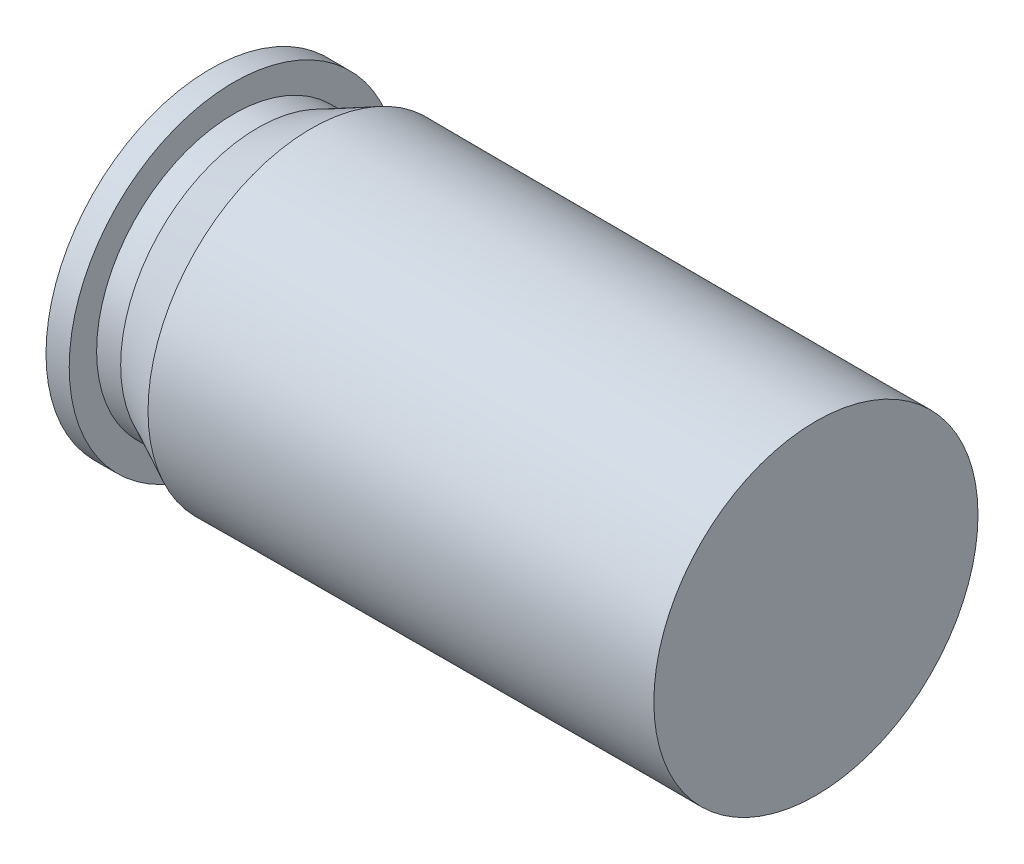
from build123d import *

# Parameters (mm, degrees)
CUT_EXTRUDE1_DEPTH = 0.25
CUT_EXTRUDE2_DEPTH = 0.25


with BuildPart() as part:
    # Sketch1 → Revolve2 (revolve)
    with BuildSketch(Plane.XY, mode=Mode.PRIVATE) as revolve2_sk:
        Polygon((0, 0), (0, 5.552303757), (0.38, 6.095), (1.24, 6.095), (1.24, 5.08), (2.131456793, 5.08), (4.11, 6.045), (22.81, 6.005), (22.81, 0), (22.641116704, 0), align=None)
    revolve(revolve2_sk.sketch.rotate(Axis((0, 0, 0), (1, 0, 0)), 90), axis=Axis((0, 0, 0), (1, 0, 0)))

    # Sketch2 → Cut-Extrude1 (cut)
    # profile 1 of 6: a face of its own
    with BuildSketch(Plane.ZY):
        Polygon((-3.042432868, -2.588485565), (-3.024404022, -2.612824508), (-3.861843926, -3.232415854), (-3.75427181, -3.377848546), (-3.869355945, -3.463185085), (-3.97692806, -3.317752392), (-4.256375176, -3.524483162), (-4.345317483, -3.404591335), (-4.065870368, -3.197860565), (-4.491050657, -2.623341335), align=None)
        Polygon((-3.950786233, -3.112524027), (-3.449884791, -2.742031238), (-4.212504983, -2.758557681), align=None, mode=Mode.SUBTRACT)
    # profile 2 of 6: a face of its own
    with BuildSketch(Plane.ZY):
        with BuildLine():
            Line((-2.050397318, -3.48956887), (-2.135132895, -3.603751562))
            Line((-2.135132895, -3.603751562), (-2.563317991, -3.285842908))
            Line((-2.563317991, -3.285842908), (-2.866503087, -3.569196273))
            add(Edge.make_bspline(
                [(-2.866503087, -3.569196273), (-2.851190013, -3.575100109), (-2.821490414, -3.586550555), (-2.779848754, -3.606537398), (-2.741786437, -3.627205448), (-2.71912428, -3.643389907), (-2.708149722, -3.651227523)],
                knots=[0, 0, 0, 0, 1.100237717, 2.133903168, 3.096309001, 4, 4, 4, 4], degree=3))
            add(Edge.make_bspline(
                [(-2.708149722, -3.651227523), (-2.694917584, -3.661495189), (-2.668974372, -3.681626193), (-2.634315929, -3.71554438), (-2.604040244, -3.751486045), (-2.578053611, -3.789534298), (-2.556247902, -3.829642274), (-2.539023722, -3.871972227), (-2.526450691, -3.916441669), (-2.518111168, -3.962427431), (-2.514131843, -4.009221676), (-2.515037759, -4.055945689), (-2.520722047, -4.102082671), (-2.531453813, -4.147659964), (-2.546808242, -4.192613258), (-2.566748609, -4.23717088), (-2.591900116, -4.280861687), (-2.611570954, -4.308828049), (-2.62161126, -4.323102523)],
                knots=[0, 0, 0, 0, 1.057630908, 2.073613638, 3.057386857, 4.022891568, 4.980083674, 5.93677347, 6.904371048, 7.895021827, 8.885773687, 9.866957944, 10.842738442, 11.817594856, 12.820322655, 13.840161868, 14.897584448, 16, 16, 16, 16], degree=3))
            add(Edge.make_bspline(
                [(-2.62161126, -4.323102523), (-2.629012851, -4.332707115), (-2.643691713, -4.351754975), (-2.667535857, -4.378600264), (-2.692816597, -4.403490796), (-2.719192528, -4.42671643), (-2.746994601, -4.447771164), (-2.775886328, -4.467048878), (-2.80606146, -4.484577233), (-2.847523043, -4.505098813), (-2.900837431, -4.525330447), (-2.966311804, -4.540776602), (-3.032502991, -4.545979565), (-3.087773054, -4.543190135), (-3.131618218, -4.5358259), (-3.164546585, -4.528488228), (-3.196893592, -4.518126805), (-3.228936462, -4.505647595), (-3.260932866, -4.491374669), (-3.292291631, -4.474113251), (-3.323537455, -4.454820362), (-3.343648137, -4.440411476), (-3.353882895, -4.433078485)],
                knots=[0, 0, 0, 0, 0.876650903, 1.738577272, 2.593874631, 3.440789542, 4.27807993, 5.113739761, 5.951030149, 6.799677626, 8.456955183, 10.062772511, 11.647081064, 13.242870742, 14.05017751, 14.860144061, 15.680215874, 16.503384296, 17.346170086, 18.211498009, 19.089792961, 20, 20, 20, 20], degree=3))
            add(Edge.make_bspline(
                [(-3.353882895, -4.433078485), (-3.365670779, -4.423966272), (-3.388842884, -4.406053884), (-3.420183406, -4.376113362), (-3.447858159, -4.34440903), (-3.472552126, -4.31126445), (-3.493225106, -4.276025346), (-3.510374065, -4.239150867), (-3.524444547, -4.200717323), (-3.534430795, -4.16070195), (-3.541044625, -4.119887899), (-3.544145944, -4.078965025), (-3.543253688, -4.038205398), (-3.538343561, -3.997788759), (-3.529883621, -3.95767751), (-3.517835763, -3.91782471), (-3.501805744, -3.878261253), (-3.488602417, -3.852652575), (-3.481887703, -3.839628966)],
                knots=[0, 0, 0, 0, 1.072612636, 2.10849487, 3.115640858, 4.101160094, 5.081091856, 6.052568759, 7.027041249, 8.024398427, 9.018305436, 10.002106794, 10.976285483, 11.949876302, 12.930418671, 13.925477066, 14.944975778, 16, 16, 16, 16], degree=3))
            Line((-3.481887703, -3.839628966), (-3.358690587, -3.9312756))
            add(Edge.make_bspline(
                [(-3.358690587, -3.9312756), (-3.364332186, -3.944202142), (-3.375221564, -3.969152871), (-3.387257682, -4.006927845), (-3.393785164, -4.043397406), (-3.396255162, -4.078634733), (-3.393229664, -4.113050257), (-3.386460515, -4.147227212), (-3.374558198, -4.181093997), (-3.359560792, -4.214785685), (-3.340519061, -4.24704674), (-3.31770491, -4.276579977), (-3.292257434, -4.303684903), (-3.272857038, -4.319023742), (-3.263137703, -4.326708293)],
                knots=[0, 0, 0, 0, 1.144156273, 2.208443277, 3.208040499, 4.144476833, 5.065835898, 6.003118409, 6.964410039, 7.972070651, 8.992435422, 9.995463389, 10.995754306, 12, 12, 12, 12], degree=3))
            add(Edge.make_bspline(
                [(-3.263137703, -4.326708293), (-3.253249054, -4.333618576), (-3.233656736, -4.347309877), (-3.202365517, -4.364135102), (-3.169904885, -4.377211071), (-3.136403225, -4.386441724), (-3.102008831, -4.392541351), (-3.066542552, -4.39503607), (-3.030031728, -4.393228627), (-2.992794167, -4.388604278), (-2.955852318, -4.38026173), (-2.920153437, -4.368438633), (-2.88599578, -4.353492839), (-2.853724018, -4.334598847), (-2.822924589, -4.312586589), (-2.79375526, -4.287150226), (-2.765802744, -4.258639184), (-2.749304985, -4.23724466), (-2.740902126, -4.226347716)],
                knots=[0, 0, 0, 0, 0.977084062, 1.935890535, 2.871955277, 3.807456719, 4.746964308, 5.698908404, 6.681942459, 7.704885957, 8.736775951, 9.745579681, 10.748619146, 11.752446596, 12.770612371, 13.81219467, 14.885677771, 16, 16, 16, 16], degree=3))
            add(Edge.make_bspline(
                [(-2.740902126, -4.226347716), (-2.733810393, -4.216247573), (-2.719911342, -4.196452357), (-2.702506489, -4.165324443), (-2.688189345, -4.134044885), (-2.677543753, -4.102229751), (-2.670623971, -4.070076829), (-2.667320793, -4.037526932), (-2.667373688, -4.004716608), (-2.67055754, -3.971652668), (-2.677618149, -3.939102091), (-2.687375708, -3.907242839), (-2.701129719, -3.876816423), (-2.717978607, -3.847404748), (-2.738640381, -3.819561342), (-2.762181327, -3.792552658), (-2.789321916, -3.766973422), (-2.809376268, -3.751424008), (-2.819628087, -3.74347512)],
                knots=[0, 0, 0, 0, 1.074592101, 2.106087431, 3.101977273, 4.067784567, 5.022809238, 5.961427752, 6.912577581, 7.877240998, 8.849335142, 9.809766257, 10.77462699, 11.751994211, 12.757320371, 13.789996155, 14.870242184, 16, 16, 16, 16], degree=3))
            add(Edge.make_bspline(
                [(-2.819628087, -3.74347512), (-2.828853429, -3.736928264), (-2.84786095, -3.723439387), (-2.879011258, -3.705274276), (-2.912882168, -3.687850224), (-2.949764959, -3.671655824), (-2.989399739, -3.656406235), (-3.0319057, -3.641996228), (-3.077259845, -3.628362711), (-3.108752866, -3.620637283), (-3.124916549, -3.616672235)],
                knots=[0, 0, 0, 0, 0.81571272, 1.680661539, 2.598412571, 3.562413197, 4.584890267, 5.661100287, 6.799567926, 8, 8, 8, 8], degree=3))
            Line((-3.124916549, -3.616672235), (-2.57083001, -3.10285012))
            Line((-2.57083001, -3.10285012), (-2.050397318, -3.48956887))
        make_face()
    # profile 3 of 6: a face of its own
    with BuildSketch(Plane.ZY):
        Polygon((-0.43310409, -3.985758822), (0.095742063, -5.538643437), (-0.062911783, -5.521516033), (-0.242298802, -5.010097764), (-0.879318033, -4.940987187), (-1.16327236, -5.401924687), (-1.327935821, -5.384196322), (-0.469161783, -3.981852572), align=None)
        Polygon((-0.485087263, -4.29765786), (-0.797587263, -4.80547036), (-0.29217861, -4.86015786), align=None, mode=Mode.SUBTRACT)
    # profile 4 of 6: a face of its own
    with BuildSketch(Plane.ZY):
        with BuildLine():
            Line((0.476907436, -4.018437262), (0.621739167, -3.98237957))
            Line((0.621739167, -3.98237957), (0.838385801, -4.857980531))
            add(Edge.make_bspline(
                [(0.838385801, -4.857980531), (0.841495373, -4.87029911), (0.847411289, -4.893735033), (0.855765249, -4.927128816), (0.863481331, -4.956805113), (0.870819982, -4.982685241), (0.877039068, -5.004976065), (0.882641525, -5.02354749), (0.887771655, -5.038339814), (0.891052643, -5.046889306), (0.89247234, -5.050588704)],
                knots=[0, 0, 0, 0, 1.523314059, 2.898083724, 4.127304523, 5.199552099, 6.123318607, 6.902062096, 7.524917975, 8, 8, 8, 8], degree=3))
            add(Edge.make_bspline(
                [(0.89247234, -5.050588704), (0.89803188, -5.063824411), (0.908804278, -5.089470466), (0.928614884, -5.124983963), (0.951590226, -5.155757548), (0.977241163, -5.182673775), (1.006935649, -5.205377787), (1.041504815, -5.223577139), (1.080385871, -5.23866858), (1.123208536, -5.24933044), (1.167670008, -5.256373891), (1.212090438, -5.257946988), (1.255526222, -5.255760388), (1.283551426, -5.249782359), (1.297520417, -5.246802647)],
                knots=[0, 0, 0, 0, 1.042740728, 2.020457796, 2.946272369, 3.826475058, 4.714467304, 5.649108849, 6.656080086, 7.738211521, 8.849923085, 9.920735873, 10.963603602, 12, 12, 12, 12], degree=3))
            add(Edge.make_bspline(
                [(1.297520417, -5.246802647), (1.309337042, -5.243476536), (1.332827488, -5.236864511), (1.366289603, -5.221987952), (1.398465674, -5.20440758), (1.428299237, -5.18264916), (1.455807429, -5.15830863), (1.480093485, -5.131285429), (1.500997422, -5.102029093), (1.518170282, -5.070304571), (1.5316546, -5.036368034), (1.542054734, -5.000396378), (1.548315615, -4.962155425), (1.549580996, -4.935927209), (1.550224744, -4.922583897)],
                knots=[0, 0, 0, 0, 0.995365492, 1.978701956, 2.965126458, 3.967079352, 4.969164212, 5.942227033, 6.910146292, 7.881611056, 8.863063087, 9.869394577, 10.916078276, 12, 12, 12, 12], degree=3))
            add(Edge.make_bspline(
                [(1.550224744, -4.922583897), (1.550207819, -4.917071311), (1.550170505, -4.90491744), (1.548096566, -4.884861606), (1.544746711, -4.861336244), (1.540199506, -4.834290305), (1.534447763, -4.803724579), (1.527271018, -4.76965377), (1.518423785, -4.732043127), (1.512079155, -4.705833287), (1.508758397, -4.692115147)],
                knots=[0, 0, 0, 0, 0.563622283, 1.242645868, 2.059887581, 2.994745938, 4.047742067, 5.241388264, 6.556152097, 8, 8, 8, 8], degree=3))
            Line((1.508758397, -4.692115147), (1.292111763, -3.816514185))
            Line((1.292111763, -3.816514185), (1.437243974, -3.780756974))
            Line((1.437243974, -3.780756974), (1.653890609, -4.656357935))
            add(Edge.make_bspline(
                [(1.653890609, -4.656357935), (1.657698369, -4.672160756), (1.665123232, -4.702975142), (1.674302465, -4.748511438), (1.682386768, -4.791924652), (1.687861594, -4.833476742), (1.692396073, -4.87281775), (1.694309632, -4.910241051), (1.695084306, -4.945626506), (1.693920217, -4.979344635), (1.69075232, -5.011828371), (1.684626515, -5.043683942), (1.675847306, -5.075076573), (1.664907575, -5.106301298), (1.650288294, -5.136578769), (1.634425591, -5.167176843), (1.61482045, -5.196776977), (1.593526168, -5.226159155), (1.569621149, -5.254010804), (1.543258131, -5.279717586), (1.514810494, -5.303191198), (1.483930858, -5.323946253), (1.451075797, -5.342364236), (1.415933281, -5.358235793), (1.378789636, -5.37228798), (1.352779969, -5.379143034), (1.339587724, -5.382619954)],
                knots=[0, 0, 0, 0, 1.299272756, 2.533490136, 3.712968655, 4.828307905, 5.883150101, 6.87755384, 7.822472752, 8.711786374, 9.573011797, 10.42882359, 11.30099598, 12.177274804, 13.06921565, 13.986211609, 14.930078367, 15.903732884, 16.885942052, 17.859794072, 18.843959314, 19.829946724, 20.83003952, 21.851160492, 22.91009694, 24, 24, 24, 24], degree=3))
            add(Edge.make_bspline(
                [(1.339587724, -5.382619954), (1.325204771, -5.385935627), (1.29680548, -5.392482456), (1.254187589, -5.398509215), (1.212569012, -5.402452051), (1.171774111, -5.40261796), (1.131884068, -5.400036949), (1.092950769, -5.394165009), (1.054872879, -5.385940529), (1.018064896, -5.374104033), (0.982680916, -5.35978646), (0.949340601, -5.342956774), (0.918123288, -5.323950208), (0.889165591, -5.30252779), (0.862303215, -5.278704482), (0.83762191, -5.252422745), (0.81493945, -5.223966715), (0.801942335, -5.203361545), (0.795417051, -5.193016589)],
                knots=[0, 0, 0, 0, 1.144258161, 2.259349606, 3.335415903, 4.384160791, 5.419703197, 6.432620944, 7.435299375, 8.437676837, 9.427269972, 10.39306903, 11.331004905, 12.258556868, 13.183013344, 14.111735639, 15.051984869, 16, 16, 16, 16], degree=3))
            add(Edge.make_bspline(
                [(0.795417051, -5.193016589), (0.791281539, -5.185871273), (0.782292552, -5.17034015), (0.770737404, -5.143757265), (0.758314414, -5.113036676), (0.745788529, -5.0778168), (0.732985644, -5.038204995), (0.719615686, -4.994192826), (0.706611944, -4.945614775), (0.698019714, -4.911676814), (0.693554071, -4.894038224)],
                knots=[0, 0, 0, 0, 0.625093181, 1.358708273, 2.193013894, 3.13644077, 4.190042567, 5.347305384, 6.621313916, 8, 8, 8, 8], degree=3))
            Line((0.693554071, -4.894038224), (0.476907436, -4.018437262))
        make_face()
    # profile 5 of 6: a face of its own
    with BuildSketch(Plane.ZY):
        Polygon((1.784738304, -3.808198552), (1.710820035, -3.683499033), (2.415447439, -3.265229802), (2.489365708, -3.389929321), (2.203007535, -3.560001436), (2.891709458, -4.719857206), (2.760699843, -4.797381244), (2.07199792, -3.637525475), align=None)
    # profile 6 of 6: a face of its own
    with BuildSketch(Plane.ZY):
        with BuildLine():
            add(Edge.make_bspline(
                [(2.993287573, -2.571302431), (3.011215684, -2.550392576), (3.046501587, -2.50923804), (3.105522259, -2.454908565), (3.167379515, -2.407460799), (3.232207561, -2.366609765), (3.300924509, -2.334109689), (3.372356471, -2.307475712), (3.447412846, -2.289056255), (3.524660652, -2.277494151), (3.60253479, -2.272758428), (3.679309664, -2.27625633), (3.754193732, -2.286510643), (3.827050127, -2.305134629), (3.897964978, -2.331030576), (3.966736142, -2.364696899), (4.033666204, -2.405639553), (4.075417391, -2.438170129), (4.096652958, -2.454715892)],
                knots=[0, 0, 0, 0, 1.066948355, 2.09995555, 3.102509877, 4.086142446, 5.063849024, 6.044081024, 7.036615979, 8.053562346, 9.068609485, 10.055730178, 11.02817248, 11.993402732, 12.96500755, 13.949589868, 14.957116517, 16, 16, 16, 16], degree=3))
            add(Edge.make_bspline(
                [(4.096652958, -2.454715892), (4.116828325, -2.47217709), (4.156522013, -2.506530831), (4.20945581, -2.563787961), (4.255066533, -2.624726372), (4.29479689, -2.688677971), (4.326421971, -2.756742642), (4.352064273, -2.82794899), (4.369843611, -2.902976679), (4.381196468, -2.98039452), (4.385453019, -3.058557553), (4.382256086, -3.135564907), (4.371334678, -3.210440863), (4.353303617, -3.283276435), (4.327669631, -3.353910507), (4.294167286, -3.422210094), (4.253678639, -3.488660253), (4.221467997, -3.530130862), (4.205126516, -3.551170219)],
                knots=[0, 0, 0, 0, 1.043280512, 2.05258477, 3.043171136, 4.017630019, 4.992222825, 5.973809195, 6.973621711, 8.003243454, 9.031342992, 10.031477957, 11.013439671, 11.986613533, 12.962151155, 13.947048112, 14.95847232, 16, 16, 16, 16], degree=3))
            add(Edge.make_bspline(
                [(4.205126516, -3.551170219), (4.187504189, -3.571688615), (4.152826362, -3.612065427), (4.094576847, -3.665125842), (4.033678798, -3.711955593), (3.969004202, -3.751519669), (3.90080439, -3.784048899), (3.829267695, -3.809785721), (3.75430552, -3.828023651), (3.677039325, -3.839320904), (3.599188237, -3.843495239), (3.522491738, -3.840688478), (3.447997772, -3.830106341), (3.375722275, -3.812274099), (3.305582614, -3.787240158), (3.237754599, -3.75456063), (3.172092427, -3.71448699), (3.131216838, -3.682689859), (3.110475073, -3.666554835)],
                knots=[0, 0, 0, 0, 1.058309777, 2.08257879, 3.078881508, 4.063042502, 5.045505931, 6.03307667, 7.034807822, 8.061567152, 9.086766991, 10.083810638, 11.062304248, 12.027882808, 12.994345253, 13.973271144, 14.971563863, 16, 16, 16, 16], degree=3))
            add(Edge.make_bspline(
                [(3.110475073, -3.666554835), (3.096993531, -3.655113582), (3.070277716, -3.632440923), (3.033227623, -3.595489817), (2.998951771, -3.556712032), (2.967352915, -3.516058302), (2.938386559, -3.47370101), (2.912581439, -3.429324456), (2.889231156, -3.383279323), (2.869374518, -3.335364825), (2.852169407, -3.286450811), (2.838318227, -3.236983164), (2.82814135, -3.187261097), (2.821129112, -3.137385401), (2.817588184, -3.087292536), (2.817166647, -3.036892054), (2.820629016, -2.986310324), (2.827138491, -2.935709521), (2.837124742, -2.885658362), (2.849889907, -2.836593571), (2.866297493, -2.788984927), (2.885546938, -2.742612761), (2.907758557, -2.697502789), (2.93310669, -2.653875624), (2.961350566, -2.611483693), (2.982575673, -2.584779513), (2.993287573, -2.571302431)],
                knots=[0, 0, 0, 0, 1.038466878, 2.057886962, 3.070901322, 4.077279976, 5.081023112, 6.083178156, 7.091069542, 8.111779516, 9.127882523, 10.13582544, 11.127141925, 12.107447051, 13.092667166, 14.075371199, 15.066058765, 16.068904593, 17.070593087, 18.062555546, 19.045083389, 20.026412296, 21.010630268, 21.996693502, 22.988970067, 24, 24, 24, 24], degree=3))
        make_face()
        with BuildLine():
            add(Edge.make_bspline(
                [(3.109874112, -2.658141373), (3.101389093, -2.668832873), (3.084541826, -2.690061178), (3.062339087, -2.724102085), (3.042241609, -2.759102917), (3.024371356, -2.795388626), (3.008918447, -2.832979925), (2.996574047, -2.87208783), (2.985837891, -2.912237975), (2.977831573, -2.953399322), (2.972433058, -2.995051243), (2.96970681, -3.036602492), (2.96968525, -3.077758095), (2.972421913, -3.118611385), (2.977800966, -3.159070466), (2.985914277, -3.199133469), (2.99688597, -3.238743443), (3.010271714, -3.277944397), (3.026462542, -3.316287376), (3.045208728, -3.353386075), (3.066187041, -3.389185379), (3.089799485, -3.423528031), (3.115660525, -3.456762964), (3.144256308, -3.48839514), (3.174881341, -3.519113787), (3.197166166, -3.537811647), (3.208431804, -3.547263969)],
                knots=[0, 0, 0, 0, 0.987347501, 1.960409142, 2.937727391, 3.907028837, 4.885636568, 5.875933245, 6.872840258, 7.892133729, 8.908122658, 9.910574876, 10.903653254, 11.88440635, 12.87164741, 13.85539616, 14.8401859, 15.844235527, 16.851263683, 17.849724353, 18.850497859, 19.851770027, 20.863898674, 21.895693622, 22.936210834, 24, 24, 24, 24], degree=3))
            add(Edge.make_bspline(
                [(3.208431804, -3.547263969), (3.225536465, -3.560495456), (3.259226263, -3.586556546), (3.312961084, -3.619792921), (3.368500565, -3.646622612), (3.425565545, -3.667523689), (3.484266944, -3.682321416), (3.544676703, -3.691166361), (3.606793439, -3.693269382), (3.669766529, -3.69011875), (3.732043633, -3.680868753), (3.792145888, -3.6660164), (3.849591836, -3.646354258), (3.903893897, -3.620576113), (3.955284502, -3.589511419), (4.003529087, -3.552770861), (4.049287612, -3.511053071), (4.076531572, -3.479450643), (4.090342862, -3.463429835)],
                knots=[0, 0, 0, 0, 1.051941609, 2.071932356, 3.068271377, 4.049046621, 5.024416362, 6.009530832, 7.01445428, 8.044390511, 9.074326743, 10.073345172, 11.053805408, 12.02414366, 12.993060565, 13.970912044, 14.971356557, 16, 16, 16, 16], degree=3))
            add(Edge.make_bspline(
                [(4.090342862, -3.463429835), (4.099224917, -3.452337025), (4.116861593, -3.430310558), (4.140229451, -3.395207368), (4.161261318, -3.359165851), (4.179973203, -3.322200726), (4.196018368, -3.284174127), (4.209133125, -3.24504354), (4.220024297, -3.204919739), (4.228402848, -3.163979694), (4.234094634, -3.122622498), (4.237092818, -3.081375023), (4.237541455, -3.040404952), (4.234628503, -2.999874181), (4.229651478, -2.959584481), (4.221578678, -2.919684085), (4.210204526, -2.880260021), (4.196879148, -2.84121218), (4.180608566, -2.803101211), (4.161874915, -2.766166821), (4.141277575, -2.730206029), (4.117711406, -2.695969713), (4.091735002, -2.663116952), (4.06350317, -2.631543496), (4.032758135, -2.601357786), (4.010731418, -2.582591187), (3.99959767, -2.573105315)],
                knots=[0, 0, 0, 0, 1.024795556, 2.034887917, 3.038757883, 4.034087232, 5.02183341, 6.013562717, 7.009206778, 8.019635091, 9.026232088, 10.018829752, 11.00159424, 11.979271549, 12.948150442, 13.928814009, 14.912454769, 15.906524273, 16.903740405, 17.899069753, 18.893060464, 19.891192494, 20.894464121, 21.912819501, 22.945001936, 24, 24, 24, 24], degree=3))
            add(Edge.make_bspline(
                [(3.99959767, -2.573105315), (3.988184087, -2.564051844), (3.965645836, -2.546174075), (3.930270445, -2.521985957), (3.893969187, -2.50070587), (3.85685827, -2.482126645), (3.819228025, -2.465528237), (3.780382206, -2.452609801), (3.74092585, -2.441574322), (3.700737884, -2.433552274), (3.660189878, -2.428165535), (3.619532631, -2.425302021), (3.578883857, -2.425857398), (3.538297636, -2.428297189), (3.497774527, -2.434242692), (3.457310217, -2.442565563), (3.41688321, -2.453788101), (3.376858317, -2.467555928), (3.337546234, -2.483653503), (3.299897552, -2.502293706), (3.263737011, -2.522762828), (3.229651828, -2.545789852), (3.196635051, -2.570178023), (3.166054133, -2.597583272), (3.136703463, -2.626556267), (3.118839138, -2.647587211), (3.109874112, -2.658141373)],
                knots=[0, 0, 0, 0, 1.05441495, 2.082139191, 3.099399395, 4.098169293, 5.085503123, 6.073795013, 7.058889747, 8.05005026, 9.037597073, 10.018653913, 10.997564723, 11.978621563, 12.959973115, 13.959690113, 14.967682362, 15.994971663, 17.022388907, 18.040630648, 19.034439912, 20.027905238, 21.016941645, 22.003289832, 22.997971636, 24, 24, 24, 24], degree=3))
        make_face(mode=Mode.SUBTRACT)
    extrude(amount=-CUT_EXTRUDE1_DEPTH, mode=Mode.SUBTRACT)

    # Sketch3 → Cut-Extrude2 (cut)
    # profile 1 of 3: a face of its own
    with BuildSketch(Plane.ZY):
        with BuildLine():
            Line((3.380271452, 2.461941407), (3.232735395, 2.478167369))
            add(Edge.make_bspline(
                [(3.232735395, 2.478167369), (3.233975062, 2.491378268), (3.236422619, 2.517461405), (3.237666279, 2.556495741), (3.236363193, 2.594913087), (3.233202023, 2.632866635), (3.227336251, 2.670260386), (3.21961833, 2.707099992), (3.209638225, 2.743443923), (3.197368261, 2.779064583), (3.182769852, 2.813965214), (3.166739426, 2.848225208), (3.148288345, 2.881405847), (3.127673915, 2.913534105), (3.105653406, 2.945184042), (3.080990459, 2.975551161), (3.054798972, 3.005410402), (3.035648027, 3.024063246), (3.026004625, 3.03345583)],
                knots=[0, 0, 0, 0, 1.035572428, 2.04459803, 3.045809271, 4.03464253, 5.015407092, 5.998288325, 6.971294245, 7.955325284, 8.93680629, 9.923008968, 10.90638758, 11.897566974, 12.901856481, 13.914057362, 14.94962979, 16, 16, 16, 16], degree=3))
            add(Edge.make_bspline(
                [(3.026004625, 3.03345583), (3.015232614, 3.043538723), (2.993835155, 3.06356732), (2.959357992, 3.090486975), (2.923904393, 3.115090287), (2.887415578, 3.137708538), (2.849241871, 3.156960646), (2.810060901, 3.174218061), (2.769674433, 3.189079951), (2.728151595, 3.200903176), (2.686109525, 3.210248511), (2.644155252, 3.216837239), (2.602410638, 3.220791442), (2.561052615, 3.22206663), (2.51986641, 3.220286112), (2.479063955, 3.215271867), (2.438339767, 3.208256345), (2.398116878, 3.197927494), (2.358592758, 3.18503394), (2.319967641, 3.169753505), (2.282567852, 3.15157109), (2.246188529, 3.130860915), (2.210931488, 3.107377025), (2.177031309, 3.081013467), (2.143740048, 3.052621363), (2.123016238, 3.03170605), (2.112543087, 3.021136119)],
                knots=[0, 0, 0, 0, 1.04218917, 2.070198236, 3.087233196, 4.091105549, 5.100873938, 6.105544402, 7.115387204, 8.139123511, 9.154013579, 10.157062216, 11.138119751, 12.115263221, 13.078777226, 14.047993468, 15.01847519, 15.996950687, 16.979538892, 17.954757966, 18.929745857, 19.915616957, 20.91086921, 21.920240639, 22.948956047, 24, 24, 24, 24], degree=3))
            add(Edge.make_bspline(
                [(2.112543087, 3.021136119), (2.097471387, 3.004699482), (2.067846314, 2.972391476), (2.029982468, 2.919611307), (1.997906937, 2.865179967), (1.972028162, 2.808535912), (1.952940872, 2.749803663), (1.93953295, 2.689130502), (1.932359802, 2.626507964), (1.93150566, 2.562488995), (1.936932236, 2.498501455), (1.948214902, 2.435726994), (1.966124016, 2.37505561), (1.989973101, 2.316467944), (2.019964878, 2.259889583), (2.056220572, 2.205376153), (2.098755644, 2.15281487), (2.130979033, 2.120324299), (2.147398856, 2.10376833)],
                knots=[0, 0, 0, 0, 1.04193158, 2.048030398, 3.030359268, 3.992349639, 4.953507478, 5.912552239, 6.893126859, 7.895436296, 8.901186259, 9.89142063, 10.872464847, 11.853453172, 12.844373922, 13.861411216, 14.910255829, 16, 16, 16, 16], degree=3))
            add(Edge.make_bspline(
                [(2.147398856, 2.10376833), (2.166350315, 2.086476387), (2.203607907, 2.052481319), (2.265423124, 2.010037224), (2.329813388, 1.97490067), (2.397413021, 1.947750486), (2.467791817, 1.927899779), (2.541338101, 1.916838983), (2.617780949, 1.91252123), (2.669444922, 1.916197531), (2.69577626, 1.918071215)],
                knots=[0, 0, 0, 0, 1.027907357, 2.020812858, 2.998667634, 3.964708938, 4.936454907, 5.924496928, 6.942187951, 8, 8, 8, 8], degree=3))
            Line((2.69577626, 1.918071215), (2.718913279, 1.772037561))
            add(Edge.make_bspline(
                [(2.718913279, 1.772037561), (2.704009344, 1.770111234), (2.674380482, 1.766281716), (2.629789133, 1.764522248), (2.585447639, 1.764607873), (2.541224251, 1.767819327), (2.497011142, 1.772961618), (2.453048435, 1.78167733), (2.409155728, 1.792353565), (2.365591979, 1.805874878), (2.322632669, 1.822222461), (2.280189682, 1.840739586), (2.238603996, 1.86222496), (2.197827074, 1.886272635), (2.157709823, 1.91271925), (2.118607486, 1.94206087), (2.080132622, 1.973780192), (2.055538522, 1.996669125), (2.043132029, 2.008215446)],
                knots=[0, 0, 0, 0, 0.972097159, 1.932518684, 2.88540772, 3.840476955, 4.80046089, 5.764092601, 6.738822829, 7.722948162, 8.713775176, 9.712206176, 10.718183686, 11.740957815, 12.774703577, 13.826101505, 14.903377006, 16, 16, 16, 16], degree=3))
            add(Edge.make_bspline(
                [(2.043132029, 2.008215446), (2.031622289, 2.019543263), (2.008946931, 2.041860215), (1.976900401, 2.076516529), (1.947594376, 2.111959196), (1.920312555, 2.147875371), (1.895493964, 2.184416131), (1.872825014, 2.221462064), (1.852571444, 2.259141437), (1.834930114, 2.297523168), (1.819572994, 2.336473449), (1.806247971, 2.3758376), (1.795479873, 2.415791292), (1.786974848, 2.456309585), (1.780969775, 2.49745782), (1.777513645, 2.539201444), (1.775774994, 2.581527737), (1.776726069, 2.609878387), (1.777206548, 2.624201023)],
                knots=[0, 0, 0, 0, 1.117997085, 2.20256793, 3.266253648, 4.300902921, 5.324148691, 6.323163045, 7.306653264, 8.284036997, 9.245972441, 10.204276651, 11.1597666, 12.109071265, 13.069180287, 14.036673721, 15.008135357, 16, 16, 16, 16], degree=3))
            add(Edge.make_bspline(
                [(1.777206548, 2.624201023), (1.779014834, 2.648102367), (1.782602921, 2.69552856), (1.796683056, 2.765155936), (1.81610625, 2.832910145), (1.842173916, 2.898508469), (1.874030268, 2.962354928), (1.912881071, 3.023617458), (1.957375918, 3.083317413), (1.991315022, 3.120376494), (2.008576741, 3.139225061)],
                knots=[0, 0, 0, 0, 0.996060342, 1.976430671, 2.948044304, 3.924281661, 4.907929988, 5.911168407, 6.937602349, 8, 8, 8, 8], degree=3))
            add(Edge.make_bspline(
                [(2.008576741, 3.139225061), (2.027647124, 3.158153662), (2.06510533, 3.195333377), (2.126720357, 3.243523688), (2.190860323, 3.28478798), (2.258331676, 3.318280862), (2.32863011, 3.344525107), (2.401831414, 3.363524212), (2.477929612, 3.375317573), (2.556126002, 3.379215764), (2.634725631, 3.37652035), (2.711953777, 3.365644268), (2.78687061, 3.347092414), (2.859861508, 3.32163679), (2.930223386, 3.287615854), (2.99846263, 3.24642945), (3.064774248, 3.198093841), (3.105586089, 3.160479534), (3.126365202, 3.141328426)],
                knots=[0, 0, 0, 0, 1.032498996, 2.028043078, 3.001405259, 3.960836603, 4.918782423, 5.881940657, 6.864102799, 7.874665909, 8.888372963, 9.884088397, 10.867759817, 11.852041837, 12.851237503, 13.867159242, 14.914076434, 16, 16, 16, 16], degree=3))
            add(Edge.make_bspline(
                [(3.126365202, 3.141328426), (3.138611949, 3.129232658), (3.162820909, 3.105322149), (3.19657678, 3.067634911), (3.227380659, 3.028874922), (3.256010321, 2.989382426), (3.281299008, 2.948556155), (3.304393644, 2.906942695), (3.324479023, 2.864246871), (3.341876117, 2.820681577), (3.356686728, 2.776577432), (3.368304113, 2.732064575), (3.377424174, 2.687435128), (3.383677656, 2.642676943), (3.387442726, 2.597729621), (3.387853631, 2.552568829), (3.38602546, 2.507176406), (3.382192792, 2.477045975), (3.380271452, 2.461941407)],
                knots=[0, 0, 0, 0, 1.095679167, 2.165901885, 3.218522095, 4.246656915, 5.26931952, 6.27391065, 7.275116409, 8.270946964, 9.259009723, 10.234961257, 11.197889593, 12.157391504, 13.110579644, 14.067153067, 15.031052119, 16, 16, 16, 16], degree=3))
        make_face()
    # profile 2 of 3: a face of its own
    with BuildSketch(Plane.ZY):
        Polygon((-0.888360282, 2.85022968), (-0.707470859, 4.346623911), (-0.683131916, 4.346924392), (-0.051220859, 3.13538593), (0.523899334, 4.372164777), (0.548238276, 4.372765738), (0.793130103, 2.88538593), (0.645894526, 2.882080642), (0.477625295, 3.946083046), (-0.027482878, 2.868258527), (-0.064742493, 2.867357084), (-0.621833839, 3.931359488), (-0.744429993, 2.853234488), align=None)
    # profile 3 of 3: a face of its own
    with BuildSketch(Plane.ZY):
        with BuildLine():
            Line((-3.294426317, 3.012642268), (-3.074173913, 3.210959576))
            add(Edge.make_bspline(
                [(-3.074173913, 3.210959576), (-3.058970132, 3.224504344), (-3.029878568, 3.250421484), (-2.987774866, 3.2872768), (-2.948887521, 3.319918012), (-2.913340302, 3.348458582), (-2.881501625, 3.373407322), (-2.85269066, 3.393931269), (-2.827633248, 3.411176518), (-2.811417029, 3.420197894), (-2.804041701, 3.424300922)],
                knots=[0, 0, 0, 0, 1.417250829, 2.711828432, 3.894521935, 4.950612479, 5.884882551, 6.709070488, 7.412870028, 8, 8, 8, 8], degree=3))
            add(Edge.make_bspline(
                [(-2.804041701, 3.424300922), (-2.79439308, 3.429150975), (-2.775302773, 3.438747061), (-2.745874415, 3.450476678), (-2.716068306, 3.459428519), (-2.686137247, 3.466667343), (-2.655589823, 3.470219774), (-2.624979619, 3.472309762), (-2.594026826, 3.471194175), (-2.56295381, 3.468041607), (-2.532082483, 3.462014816), (-2.501829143, 3.45337558), (-2.472571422, 3.441415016), (-2.443900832, 3.427062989), (-2.41616168, 3.409502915), (-2.389447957, 3.388947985), (-2.363454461, 3.365716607), (-2.347193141, 3.348598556), (-2.33889747, 3.339865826)],
                knots=[0, 0, 0, 0, 1.01123102, 2.000774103, 2.962302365, 3.924974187, 4.880349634, 5.838944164, 6.796298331, 7.777444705, 8.761815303, 9.738646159, 10.719478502, 11.718053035, 12.738382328, 13.789182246, 14.872156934, 16, 16, 16, 16], degree=3))
            add(Edge.make_bspline(
                [(-2.33889747, 3.339865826), (-2.330937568, 3.330668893), (-2.315369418, 3.312681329), (-2.294906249, 3.28415955), (-2.277021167, 3.25549682), (-2.262615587, 3.226094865), (-2.250790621, 3.196487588), (-2.241535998, 3.166398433), (-2.236064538, 3.135617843), (-2.232849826, 3.104663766), (-2.233127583, 3.073598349), (-2.235215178, 3.042684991), (-2.240977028, 3.012104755), (-2.248637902, 2.981566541), (-2.259483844, 2.951312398), (-2.273306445, 2.921463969), (-2.289005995, 2.891469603), (-2.301756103, 2.872408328), (-2.308248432, 2.862702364)],
                knots=[0, 0, 0, 0, 1.120393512, 2.191290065, 3.231391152, 4.230376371, 5.203963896, 6.167655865, 7.125361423, 8.08057272, 9.031313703, 9.984918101, 10.931887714, 11.894562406, 12.884293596, 13.888086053, 14.924617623, 16, 16, 16, 16], degree=3))
            add(Edge.make_bspline(
                [(-2.308248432, 2.862702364), (-2.313885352, 2.85503431), (-2.326223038, 2.838251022), (-2.347980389, 2.812256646), (-2.374284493, 2.783135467), (-2.404893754, 2.7506275), (-2.440417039, 2.715314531), (-2.480506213, 2.676876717), (-2.524894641, 2.635003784), (-2.556486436, 2.606528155), (-2.57297199, 2.591668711)],
                knots=[0, 0, 0, 0, 0.601805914, 1.317189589, 2.142611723, 3.083665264, 4.140798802, 5.310131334, 6.596345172, 8, 8, 8, 8], degree=3))
            Line((-2.57297199, 2.591668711), (-2.651697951, 2.520755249))
            Line((-2.651697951, 2.520755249), (-2.188957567, 2.006933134))
            Line((-2.188957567, 2.006933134), (-2.29953449, 1.907473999))
            Line((-2.29953449, 1.907473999), (-3.294426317, 3.012642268))
        make_face()
        with BuildLine():
            Line((-3.087094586, 3.004529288), (-2.74905372, 2.628928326))
            Line((-2.74905372, 2.628928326), (-2.560051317, 2.795094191))
            add(Edge.make_bspline(
                [(-2.560051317, 2.795094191), (-2.550982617, 2.803349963), (-2.533428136, 2.81933084), (-2.508899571, 2.84340084), (-2.486494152, 2.866195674), (-2.466846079, 2.888029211), (-2.4493393, 2.908574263), (-2.434776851, 2.928371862), (-2.422276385, 2.946877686), (-2.409537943, 2.970066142), (-2.397558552, 2.998832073), (-2.389075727, 3.034233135), (-2.386274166, 3.070353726), (-2.389509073, 3.106574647), (-2.397424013, 3.142267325), (-2.410857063, 3.176281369), (-2.429264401, 3.208244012), (-2.445073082, 3.227199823), (-2.453080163, 3.236800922)],
                knots=[0, 0, 0, 0, 1.135729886, 2.198457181, 3.182476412, 4.095408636, 4.918520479, 5.681065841, 6.370598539, 6.985098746, 8.128982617, 9.24499241, 10.342810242, 11.469105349, 12.601078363, 13.717358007, 14.843844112, 16, 16, 16, 16], degree=3))
            add(Edge.make_bspline(
                [(-2.453080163, 3.236800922), (-2.46164841, 3.245589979), (-2.478593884, 3.26297215), (-2.508100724, 3.284027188), (-2.540166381, 3.300600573), (-2.574469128, 3.311985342), (-2.609695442, 3.319182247), (-2.645104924, 3.320310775), (-2.679900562, 3.31615932), (-2.708378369, 3.307838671), (-2.731580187, 3.298453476), (-2.750131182, 3.288087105), (-2.77055447, 3.27640706), (-2.791945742, 3.261551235), (-2.815047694, 3.244928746), (-2.839366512, 3.225509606), (-2.865237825, 3.20389522), (-2.882709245, 3.188371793), (-2.891782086, 3.180310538)],
                knots=[0, 0, 0, 0, 1.165590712, 2.305195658, 3.430050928, 4.586926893, 5.732251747, 6.838024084, 7.941701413, 9.051406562, 9.649401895, 10.318523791, 11.070119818, 11.88659988, 12.793654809, 13.77713851, 14.845676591, 16, 16, 16, 16], degree=3))
            Line((-2.891782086, 3.180310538), (-3.087094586, 3.004529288))
        make_face(mode=Mode.SUBTRACT)
    extrude(amount=-CUT_EXTRUDE2_DEPTH, mode=Mode.SUBTRACT)


solid = part.part
